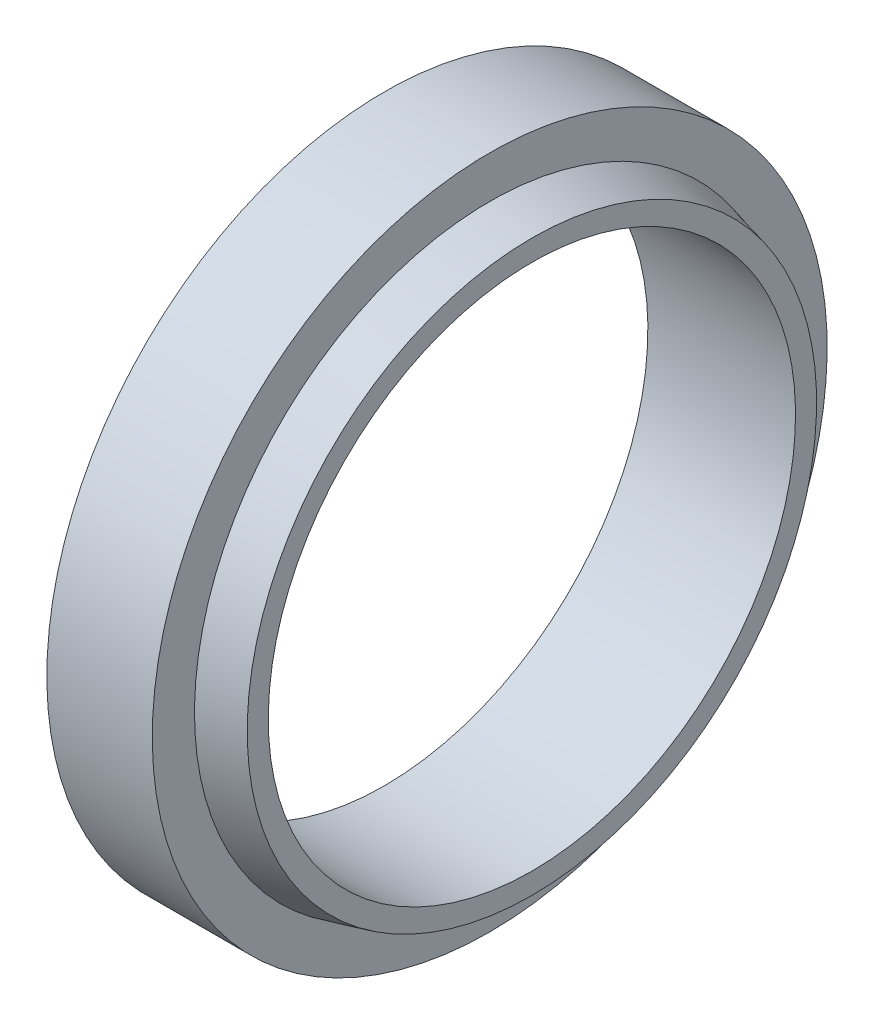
ISO-10303-21;
HEADER;
FILE_DESCRIPTION(('STEP AP214'),'2;1');
FILE_NAME('part.step','',(''),(''),'','','');
FILE_SCHEMA(('AUTOMOTIVE_DESIGN { 1 0 10303 214 1 1 1 1 }'));
ENDSEC;
DATA;
#1=APPLICATION_CONTEXT('core data for automotive mechanical design processes');
#2=APPLICATION_PROTOCOL_DEFINITION('international standard','automotive_design',2000,#1);
#3=PRODUCT_CONTEXT('',#1,'mechanical');
#4=PRODUCT('Part','Part','',(#3));
#5=PRODUCT_RELATED_PRODUCT_CATEGORY('part','',(#4));
#6=PRODUCT_DEFINITION_FORMATION('','',#4);
#7=PRODUCT_DEFINITION_CONTEXT('part definition',#1,'design');
#8=PRODUCT_DEFINITION('design','',#6,#7);
#9=PRODUCT_DEFINITION_SHAPE('','',#8);
#10=(LENGTH_UNIT() NAMED_UNIT(*) SI_UNIT(.MILLI.,.METRE.));
#11=(NAMED_UNIT(*) PLANE_ANGLE_UNIT() SI_UNIT($,.RADIAN.));
#12=(NAMED_UNIT(*) SI_UNIT($,.STERADIAN.) SOLID_ANGLE_UNIT());
#13=UNCERTAINTY_MEASURE_WITH_UNIT(LENGTH_MEASURE(1.E-05),#10,'distance_accuracy_value','');
#14=(GEOMETRIC_REPRESENTATION_CONTEXT(3) GLOBAL_UNCERTAINTY_ASSIGNED_CONTEXT((#13)) GLOBAL_UNIT_ASSIGNED_CONTEXT((#10,
#11,#12)) REPRESENTATION_CONTEXT('',''));
#15=CARTESIAN_POINT('',(0.,0.,0.));
#16=DIRECTION('',(0.,0.,1.));
#17=DIRECTION('',(1.,0.,0.));
#18=AXIS2_PLACEMENT_3D('',#15,#16,#17);
#19=CARTESIAN_POINT('',(5.00000000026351,-2.64320683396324E-10,0.));
#20=DIRECTION('',(-1.,-5.82716839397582E-11,0.));
#21=DIRECTION('',(5.82716839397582E-11,-1.,0.));
#22=AXIS2_PLACEMENT_3D('',#19,#20,#21);
#23=CONICAL_SURFACE('',#22,14.0000000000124,0.244978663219);
#24=CARTESIAN_POINT('',(6.99999999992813,-1.47777315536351E-10,0.));
#25=DIRECTION('',(-1.,-5.82716839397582E-11,0.));
#26=DIRECTION('',(5.82716839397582E-11,-1.,0.));
#27=AXIS2_PLACEMENT_3D('',#24,#25,#26);
#28=CIRCLE('',#27,13.4999999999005);
#29=CARTESIAN_POINT('',(7.0000000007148,-13.5000000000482,0.));
#30=VERTEX_POINT('',#29);
#31=EDGE_CURVE('E35',#30,#30,#28,.T.);
#32=ORIENTED_EDGE('',*,*,#31,.T.);
#33=EDGE_LOOP('',(#32));
#34=FACE_BOUND('',#33,.T.);
#35=CARTESIAN_POINT('',(5.00000000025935,-2.64320683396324E-10,0.));
#36=DIRECTION('',(-1.,-5.82716839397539E-11,0.));
#37=DIRECTION('',(5.82716839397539E-11,-1.,0.));
#38=AXIS2_PLACEMENT_3D('',#35,#36,#37);
#39=CIRCLE('',#38,14.0000000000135);
#40=CARTESIAN_POINT('',(5.00000000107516,-14.0000000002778,0.));
#41=VERTEX_POINT('',#40);
#42=EDGE_CURVE('E19',#41,#41,#39,.F.);
#43=ORIENTED_EDGE('',*,*,#42,.T.);
#44=EDGE_LOOP('',(#43));
#45=FACE_BOUND('',#44,.T.);
#46=ADVANCED_FACE('F15',(#34,#45),#23,.T.);
#47=CARTESIAN_POINT('',(4.99999999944,13.9999999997,0.));
#48=DIRECTION('',(-1.,-5.82716776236E-11,0.));
#49=DIRECTION('',(5.82716776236E-11,-1.,0.));
#50=AXIS2_PLACEMENT_3D('',#47,#48,#49);
#51=PLANE('',#50);
#52=ORIENTED_EDGE('',*,*,#42,.F.);
#53=EDGE_LOOP('',(#52));
#54=FACE_BOUND('',#53,.T.);
#55=CARTESIAN_POINT('',(5.00000000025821,-2.64320121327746E-10,0.));
#56=DIRECTION('',(-1.,-5.82716776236E-11,0.));
#57=DIRECTION('',(5.82716776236E-11,-1.,0.));
#58=AXIS2_PLACEMENT_3D('',#55,#56,#57);
#59=CIRCLE('',#58,16.);
#60=CARTESIAN_POINT('',(5.00000000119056,-16.0000000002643,0.));
#61=VERTEX_POINT('',#60);
#62=EDGE_CURVE('E33',#61,#61,#59,.T.);
#63=ORIENTED_EDGE('',*,*,#62,.F.);
#64=EDGE_LOOP('',(#63));
#65=FACE_BOUND('',#64,.T.);
#66=ADVANCED_FACE('F43',(#54,#65),#51,.F.);
#67=CARTESIAN_POINT('',(6.99999999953,12.5000000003,0.));
#68=DIRECTION('',(-1.,-5.82716776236E-11,0.));
#69=DIRECTION('',(5.82716776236E-11,-1.,0.));
#70=AXIS2_PLACEMENT_3D('',#67,#68,#69);
#71=PLANE('',#70);
#72=CARTESIAN_POINT('',(7.00000000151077,-1.47776766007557E-10,0.));
#73=DIRECTION('',(-1.,-5.82716776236E-11,0.));
#74=DIRECTION('',(5.82716776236E-11,-1.,0.));
#75=AXIS2_PLACEMENT_3D('',#72,#73,#74);
#76=CIRCLE('',#75,12.5);
#77=CARTESIAN_POINT('',(7.00000000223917,-12.5000000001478,0.));
#78=VERTEX_POINT('',#77);
#79=EDGE_CURVE('E28',#78,#78,#76,.T.);
#80=ORIENTED_EDGE('',*,*,#79,.T.);
#81=EDGE_LOOP('',(#80));
#82=FACE_BOUND('',#81,.T.);
#83=ORIENTED_EDGE('',*,*,#31,.F.);
#84=EDGE_LOOP('',(#83));
#85=FACE_BOUND('',#84,.T.);
#86=ADVANCED_FACE('F46',(#82,#85),#71,.F.);
#87=CARTESIAN_POINT('',(3.50000000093,-3.51727637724E-10,0.));
#88=DIRECTION('',(-1.,-5.82716776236E-11,0.));
#89=DIRECTION('',(5.82716776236E-11,-1.,0.));
#90=AXIS2_PLACEMENT_3D('',#87,#88,#89);
#91=CYLINDRICAL_SURFACE('',#90,16.);
#92=ORIENTED_EDGE('',*,*,#62,.T.);
#93=EDGE_LOOP('',(#92));
#94=FACE_BOUND('',#93,.T.);
#95=CARTESIAN_POINT('',(2.56145365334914E-10,-5.55678509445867E-10,0.));
#96=DIRECTION('',(-1.,-5.82716776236E-11,0.));
#97=DIRECTION('',(5.82716776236E-11,-1.,0.));
#98=AXIS2_PLACEMENT_3D('',#95,#96,#97);
#99=CIRCLE('',#98,16.);
#100=CARTESIAN_POINT('',(1.18849220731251E-09,-16.0000000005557,0.));
#101=VERTEX_POINT('',#100);
#102=EDGE_CURVE('E23',#101,#101,#99,.T.);
#103=ORIENTED_EDGE('',*,*,#102,.F.);
#104=EDGE_LOOP('',(#103));
#105=FACE_BOUND('',#104,.T.);
#106=ADVANCED_FACE('F50',(#94,#105),#91,.T.);
#107=CARTESIAN_POINT('',(3.50000000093,-3.51727637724E-10,0.));
#108=DIRECTION('',(-1.,-5.82716776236E-11,0.));
#109=DIRECTION('',(5.82716776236E-11,-1.,0.));
#110=AXIS2_PLACEMENT_3D('',#107,#108,#109);
#111=CYLINDRICAL_SURFACE('',#110,12.5);
#112=CARTESIAN_POINT('',(1.50831300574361E-09,-5.55678509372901E-10,0.));
#113=DIRECTION('',(-1.,-5.82716776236E-11,0.));
#114=DIRECTION('',(5.82716776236E-11,-1.,0.));
#115=AXIS2_PLACEMENT_3D('',#112,#113,#114);
#116=CIRCLE('',#115,12.5);
#117=CARTESIAN_POINT('',(2.23670897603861E-09,-12.5000000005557,0.));
#118=VERTEX_POINT('',#117);
#119=EDGE_CURVE('E10',#118,#118,#116,.F.);
#120=ORIENTED_EDGE('',*,*,#119,.F.);
#121=EDGE_LOOP('',(#120));
#122=FACE_BOUND('',#121,.T.);
#123=ORIENTED_EDGE('',*,*,#79,.F.);
#124=EDGE_LOOP('',(#123));
#125=FACE_BOUND('',#124,.T.);
#126=ADVANCED_FACE('F53',(#122,#125),#111,.F.);
#127=CARTESIAN_POINT('',(-4.72251571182E-10,12.4999999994,0.));
#128=DIRECTION('',(-1.,-5.82716776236E-11,0.));
#129=DIRECTION('',(5.82716776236E-11,-1.,0.));
#130=AXIS2_PLACEMENT_3D('',#127,#128,#129);
#131=PLANE('',#130);
#132=ORIENTED_EDGE('',*,*,#119,.T.);
#133=EDGE_LOOP('',(#132));
#134=FACE_BOUND('',#133,.T.);
#135=ORIENTED_EDGE('',*,*,#102,.T.);
#136=EDGE_LOOP('',(#135));
#137=FACE_BOUND('',#136,.T.);
#138=ADVANCED_FACE('F17',(#134,#137),#131,.T.);
#139=CLOSED_SHELL('',(#46,#66,#86,#106,#126,#138));
#140=MANIFOLD_SOLID_BREP('B1',#139);
#141=ADVANCED_BREP_SHAPE_REPRESENTATION('',(#18,#140),#14);
#142=SHAPE_DEFINITION_REPRESENTATION(#9,#141);
ENDSEC;
END-ISO-10303-21;
